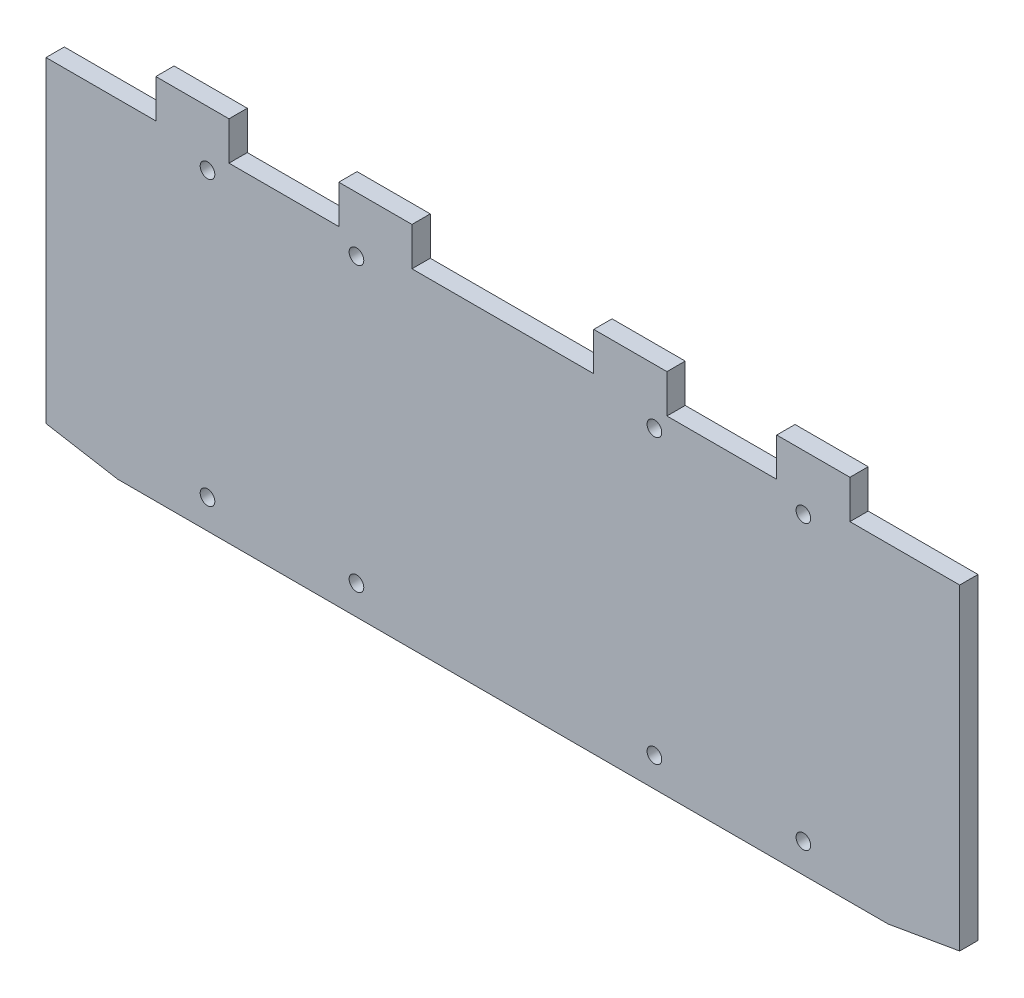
ISO-10303-21;
HEADER;
FILE_DESCRIPTION(('STEP AP214'),'2;1');
FILE_NAME('part.step','',(''),(''),'','','');
FILE_SCHEMA(('AUTOMOTIVE_DESIGN { 1 0 10303 214 1 1 1 1 }'));
ENDSEC;
DATA;
#1=APPLICATION_CONTEXT('core data for automotive mechanical design processes');
#2=APPLICATION_PROTOCOL_DEFINITION('international standard','automotive_design',2000,#1);
#3=PRODUCT_CONTEXT('',#1,'mechanical');
#4=PRODUCT('Part','Part','',(#3));
#5=PRODUCT_RELATED_PRODUCT_CATEGORY('part','',(#4));
#6=PRODUCT_DEFINITION_FORMATION('','',#4);
#7=PRODUCT_DEFINITION_CONTEXT('part definition',#1,'design');
#8=PRODUCT_DEFINITION('design','',#6,#7);
#9=PRODUCT_DEFINITION_SHAPE('','',#8);
#10=(LENGTH_UNIT() NAMED_UNIT(*) SI_UNIT(.MILLI.,.METRE.));
#11=(NAMED_UNIT(*) PLANE_ANGLE_UNIT() SI_UNIT($,.RADIAN.));
#12=(NAMED_UNIT(*) SI_UNIT($,.STERADIAN.) SOLID_ANGLE_UNIT());
#13=UNCERTAINTY_MEASURE_WITH_UNIT(LENGTH_MEASURE(1.E-05),#10,'distance_accuracy_value','');
#14=(GEOMETRIC_REPRESENTATION_CONTEXT(3) GLOBAL_UNCERTAINTY_ASSIGNED_CONTEXT((#13)) GLOBAL_UNIT_ASSIGNED_CONTEXT((#10,
#11,#12)) REPRESENTATION_CONTEXT('',''));
#15=CARTESIAN_POINT('',(0.,0.,0.));
#16=DIRECTION('',(0.,0.,1.));
#17=DIRECTION('',(1.,0.,0.));
#18=AXIS2_PLACEMENT_3D('',#15,#16,#17);
#19=CARTESIAN_POINT('',(0.,0.,3.175));
#20=DIRECTION('',(0.,0.,-1.));
#21=DIRECTION('',(-1.,0.,0.));
#22=AXIS2_PLACEMENT_3D('',#19,#20,#21);
#23=PLANE('',#22);
#24=CARTESIAN_POINT('',(-51.7,-1.66260446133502,3.175));
#25=DIRECTION('',(0.,0.,1.));
#26=DIRECTION('',(1.,0.,0.));
#27=AXIS2_PLACEMENT_3D('',#24,#25,#26);
#28=CIRCLE('',#27,1.27000000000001);
#29=CARTESIAN_POINT('',(-50.43,-1.66260446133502,3.175));
#30=VERTEX_POINT('',#29);
#31=EDGE_CURVE('E438',#30,#30,#28,.T.);
#32=ORIENTED_EDGE('',*,*,#31,.F.);
#33=EDGE_LOOP('',(#32));
#34=FACE_BOUND('',#33,.T.);
#35=CARTESIAN_POINT('',(-51.7,-50.8,3.175));
#36=DIRECTION('',(0.,0.,1.));
#37=DIRECTION('',(1.,0.,0.));
#38=AXIS2_PLACEMENT_3D('',#35,#36,#37);
#39=CIRCLE('',#38,1.27000000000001);
#40=CARTESIAN_POINT('',(-50.43,-50.8,3.175));
#41=VERTEX_POINT('',#40);
#42=EDGE_CURVE('E450',#41,#41,#39,.T.);
#43=ORIENTED_EDGE('',*,*,#42,.F.);
#44=EDGE_LOOP('',(#43));
#45=FACE_BOUND('',#44,.T.);
#46=CARTESIAN_POINT('',(-129.25,-50.8,3.175));
#47=DIRECTION('',(0.,0.,1.));
#48=DIRECTION('',(1.,0.,0.));
#49=AXIS2_PLACEMENT_3D('',#46,#47,#48);
#50=CIRCLE('',#49,1.27);
#51=CARTESIAN_POINT('',(-127.98,-50.8,3.175));
#52=VERTEX_POINT('',#51);
#53=EDGE_CURVE('E462',#52,#52,#50,.T.);
#54=ORIENTED_EDGE('',*,*,#53,.F.);
#55=EDGE_LOOP('',(#54));
#56=FACE_BOUND('',#55,.T.);
#57=CARTESIAN_POINT('',(-129.25,-1.66260446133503,3.175));
#58=DIRECTION('',(0.,0.,1.));
#59=DIRECTION('',(1.,0.,0.));
#60=AXIS2_PLACEMENT_3D('',#57,#58,#59);
#61=CIRCLE('',#60,1.27);
#62=CARTESIAN_POINT('',(-127.98,-1.66260446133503,3.175));
#63=VERTEX_POINT('',#62);
#64=EDGE_CURVE('E218',#63,#63,#61,.T.);
#65=ORIENTED_EDGE('',*,*,#64,.F.);
#66=EDGE_LOOP('',(#65));
#67=FACE_BOUND('',#66,.T.);
#68=DIRECTION('',(0.,1.,0.));
#69=VECTOR('',#68,1.);
#70=CARTESIAN_POINT('',(1.26999999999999,1.27,3.175));
#71=LINE('',#70,#69);
#72=CARTESIAN_POINT('',(1.27,-53.732604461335,3.175));
#73=VERTEX_POINT('',#72);
#74=CARTESIAN_POINT('',(1.26999999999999,1.27,3.175));
#75=VERTEX_POINT('',#74);
#76=EDGE_CURVE('E257',#73,#75,#71,.T.);
#77=ORIENTED_EDGE('',*,*,#76,.T.);
#78=DIRECTION('',(-1.,0.,0.));
#79=VECTOR('',#78,1.);
#80=CARTESIAN_POINT('',(1.26999999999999,1.27,3.175));
#81=LINE('',#80,#79);
#82=CARTESIAN_POINT('',(-17.78,1.27,3.175));
#83=VERTEX_POINT('',#82);
#84=EDGE_CURVE('E135',#75,#83,#81,.T.);
#85=ORIENTED_EDGE('',*,*,#84,.T.);
#86=DIRECTION('',(0.,1.,0.));
#87=VECTOR('',#86,1.);
#88=CARTESIAN_POINT('',(-17.78,1.27,3.175));
#89=LINE('',#88,#87);
#90=CARTESIAN_POINT('',(-17.78,7.9375,3.175));
#91=VERTEX_POINT('',#90);
#92=EDGE_CURVE('E314',#83,#91,#89,.T.);
#93=ORIENTED_EDGE('',*,*,#92,.T.);
#94=DIRECTION('',(-1.,0.,0.));
#95=VECTOR('',#94,1.);
#96=CARTESIAN_POINT('',(-17.78,7.9375,3.175));
#97=LINE('',#96,#95);
#98=CARTESIAN_POINT('',(-30.48,7.9375,3.175));
#99=VERTEX_POINT('',#98);
#100=EDGE_CURVE('E333',#91,#99,#97,.T.);
#101=ORIENTED_EDGE('',*,*,#100,.T.);
#102=DIRECTION('',(0.,-1.,0.));
#103=VECTOR('',#102,1.);
#104=CARTESIAN_POINT('',(-30.48,7.9375,3.175));
#105=LINE('',#104,#103);
#106=CARTESIAN_POINT('',(-30.48,1.27,3.175));
#107=VERTEX_POINT('',#106);
#108=EDGE_CURVE('E330',#99,#107,#105,.T.);
#109=ORIENTED_EDGE('',*,*,#108,.T.);
#110=DIRECTION('',(-1.,0.,0.));
#111=VECTOR('',#110,1.);
#112=CARTESIAN_POINT('',(-30.48,1.27,3.175));
#113=LINE('',#112,#111);
#114=CARTESIAN_POINT('',(-49.53,1.27,3.175));
#115=VERTEX_POINT('',#114);
#116=EDGE_CURVE('E332',#107,#115,#113,.T.);
#117=ORIENTED_EDGE('',*,*,#116,.T.);
#118=DIRECTION('',(0.,1.,0.));
#119=VECTOR('',#118,1.);
#120=CARTESIAN_POINT('',(-49.53,1.27,3.175));
#121=LINE('',#120,#119);
#122=CARTESIAN_POINT('',(-49.53,7.9375,3.175));
#123=VERTEX_POINT('',#122);
#124=EDGE_CURVE('E335',#115,#123,#121,.T.);
#125=ORIENTED_EDGE('',*,*,#124,.T.);
#126=DIRECTION('',(-1.,0.,0.));
#127=VECTOR('',#126,1.);
#128=CARTESIAN_POINT('',(-49.53,7.9375,3.175));
#129=LINE('',#128,#127);
#130=CARTESIAN_POINT('',(-62.23,7.9375,3.175));
#131=VERTEX_POINT('',#130);
#132=EDGE_CURVE('E341',#123,#131,#129,.T.);
#133=ORIENTED_EDGE('',*,*,#132,.T.);
#134=DIRECTION('',(0.,-1.,0.));
#135=VECTOR('',#134,1.);
#136=CARTESIAN_POINT('',(-62.23,7.9375,3.175));
#137=LINE('',#136,#135);
#138=CARTESIAN_POINT('',(-62.23,1.27,3.175));
#139=VERTEX_POINT('',#138);
#140=EDGE_CURVE('E343',#131,#139,#137,.T.);
#141=ORIENTED_EDGE('',*,*,#140,.T.);
#142=DIRECTION('',(-1.,0.,0.));
#143=VECTOR('',#142,1.);
#144=CARTESIAN_POINT('',(-93.77,1.27,3.175));
#145=LINE('',#144,#143);
#146=CARTESIAN_POINT('',(-93.77,1.27,3.175));
#147=VERTEX_POINT('',#146);
#148=EDGE_CURVE('E345',#139,#147,#145,.T.);
#149=ORIENTED_EDGE('',*,*,#148,.T.);
#150=DIRECTION('',(0.,1.,0.));
#151=VECTOR('',#150,1.);
#152=CARTESIAN_POINT('',(-93.77,7.9375,3.175));
#153=LINE('',#152,#151);
#154=CARTESIAN_POINT('',(-93.77,7.9375,3.175));
#155=VERTEX_POINT('',#154);
#156=EDGE_CURVE('E347',#147,#155,#153,.T.);
#157=ORIENTED_EDGE('',*,*,#156,.T.);
#158=DIRECTION('',(-1.,0.,0.));
#159=VECTOR('',#158,1.);
#160=CARTESIAN_POINT('',(-106.47,7.9375,3.175));
#161=LINE('',#160,#159);
#162=CARTESIAN_POINT('',(-106.47,7.9375,3.175));
#163=VERTEX_POINT('',#162);
#164=EDGE_CURVE('E349',#155,#163,#161,.T.);
#165=ORIENTED_EDGE('',*,*,#164,.T.);
#166=DIRECTION('',(0.,-1.,0.));
#167=VECTOR('',#166,1.);
#168=CARTESIAN_POINT('',(-106.47,1.27,3.175));
#169=LINE('',#168,#167);
#170=CARTESIAN_POINT('',(-106.47,1.27,3.175));
#171=VERTEX_POINT('',#170);
#172=EDGE_CURVE('E351',#163,#171,#169,.T.);
#173=ORIENTED_EDGE('',*,*,#172,.T.);
#174=DIRECTION('',(-1.,0.,0.));
#175=VECTOR('',#174,1.);
#176=CARTESIAN_POINT('',(-125.52,1.27,3.175));
#177=LINE('',#176,#175);
#178=CARTESIAN_POINT('',(-125.52,1.27,3.175));
#179=VERTEX_POINT('',#178);
#180=EDGE_CURVE('E353',#171,#179,#177,.T.);
#181=ORIENTED_EDGE('',*,*,#180,.T.);
#182=DIRECTION('',(0.,1.,0.));
#183=VECTOR('',#182,1.);
#184=CARTESIAN_POINT('',(-125.52,7.9375,3.175));
#185=LINE('',#184,#183);
#186=CARTESIAN_POINT('',(-125.52,7.9375,3.175));
#187=VERTEX_POINT('',#186);
#188=EDGE_CURVE('E355',#179,#187,#185,.T.);
#189=ORIENTED_EDGE('',*,*,#188,.T.);
#190=DIRECTION('',(-1.,0.,0.));
#191=VECTOR('',#190,1.);
#192=CARTESIAN_POINT('',(-138.22,7.9375,3.175));
#193=LINE('',#192,#191);
#194=CARTESIAN_POINT('',(-138.22,7.9375,3.175));
#195=VERTEX_POINT('',#194);
#196=EDGE_CURVE('E357',#187,#195,#193,.T.);
#197=ORIENTED_EDGE('',*,*,#196,.T.);
#198=DIRECTION('',(0.,-1.,0.));
#199=VECTOR('',#198,1.);
#200=CARTESIAN_POINT('',(-138.22,1.27,3.175));
#201=LINE('',#200,#199);
#202=CARTESIAN_POINT('',(-138.22,1.27,3.175));
#203=VERTEX_POINT('',#202);
#204=EDGE_CURVE('E359',#195,#203,#201,.T.);
#205=ORIENTED_EDGE('',*,*,#204,.T.);
#206=DIRECTION('',(-1.,0.,0.));
#207=VECTOR('',#206,1.);
#208=CARTESIAN_POINT('',(-157.27,1.27,3.175));
#209=LINE('',#208,#207);
#210=CARTESIAN_POINT('',(-157.27,1.27,3.175));
#211=VERTEX_POINT('',#210);
#212=EDGE_CURVE('E361',#203,#211,#209,.T.);
#213=ORIENTED_EDGE('',*,*,#212,.T.);
#214=DIRECTION('',(0.,-1.,0.));
#215=VECTOR('',#214,1.);
#216=CARTESIAN_POINT('',(-157.27,-53.732604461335,3.175));
#217=LINE('',#216,#215);
#218=CARTESIAN_POINT('',(-157.27,-53.732604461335,3.175));
#219=VERTEX_POINT('',#218);
#220=EDGE_CURVE('E196',#211,#219,#217,.T.);
#221=ORIENTED_EDGE('',*,*,#220,.T.);
#222=DIRECTION('',(0.985397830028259,-0.170267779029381,0.));
#223=VECTOR('',#222,1.);
#224=CARTESIAN_POINT('',(-144.842288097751,-55.88,3.175));
#225=LINE('',#224,#223);
#226=CARTESIAN_POINT('',(-144.842288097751,-55.88,3.175));
#227=VERTEX_POINT('',#226);
#228=EDGE_CURVE('E190',#219,#227,#225,.T.);
#229=ORIENTED_EDGE('',*,*,#228,.T.);
#230=DIRECTION('',(1.,0.,0.));
#231=VECTOR('',#230,1.);
#232=CARTESIAN_POINT('',(-11.1577119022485,-55.88,3.175));
#233=LINE('',#232,#231);
#234=CARTESIAN_POINT('',(-11.1577119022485,-55.88,3.175));
#235=VERTEX_POINT('',#234);
#236=EDGE_CURVE('E194',#227,#235,#233,.T.);
#237=ORIENTED_EDGE('',*,*,#236,.T.);
#238=DIRECTION('',(0.985397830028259,0.17026777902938,0.));
#239=VECTOR('',#238,1.);
#240=CARTESIAN_POINT('',(1.27,-53.732604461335,3.175));
#241=LINE('',#240,#239);
#242=EDGE_CURVE('E50',#235,#73,#241,.T.);
#243=ORIENTED_EDGE('',*,*,#242,.T.);
#244=EDGE_LOOP('',(#77,#85,#93,#101,#109,#117,#125,#133,#141,#149,#157,#165,#173,#181,#189,#197,
#205,#213,#221,#229,#237,#243));
#245=FACE_BOUND('',#244,.T.);
#246=CARTESIAN_POINT('',(-103.4,-1.66260446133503,3.175));
#247=DIRECTION('',(0.,0.,1.));
#248=DIRECTION('',(1.,0.,0.));
#249=AXIS2_PLACEMENT_3D('',#246,#247,#248);
#250=CIRCLE('',#249,1.27000000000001);
#251=CARTESIAN_POINT('',(-102.13,-1.66260446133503,3.175));
#252=VERTEX_POINT('',#251);
#253=EDGE_CURVE('E468',#252,#252,#250,.T.);
#254=ORIENTED_EDGE('',*,*,#253,.F.);
#255=EDGE_LOOP('',(#254));
#256=FACE_BOUND('',#255,.T.);
#257=CARTESIAN_POINT('',(-103.4,-50.8,3.175));
#258=DIRECTION('',(0.,0.,1.));
#259=DIRECTION('',(1.,0.,0.));
#260=AXIS2_PLACEMENT_3D('',#257,#258,#259);
#261=CIRCLE('',#260,1.27000000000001);
#262=CARTESIAN_POINT('',(-102.13,-50.8,3.175));
#263=VERTEX_POINT('',#262);
#264=EDGE_CURVE('E456',#263,#263,#261,.T.);
#265=ORIENTED_EDGE('',*,*,#264,.F.);
#266=EDGE_LOOP('',(#265));
#267=FACE_BOUND('',#266,.T.);
#268=CARTESIAN_POINT('',(-25.85,-50.8,3.175));
#269=DIRECTION('',(0.,0.,1.));
#270=DIRECTION('',(1.,0.,0.));
#271=AXIS2_PLACEMENT_3D('',#268,#269,#270);
#272=CIRCLE('',#271,1.27000000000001);
#273=CARTESIAN_POINT('',(-24.58,-50.8,3.175));
#274=VERTEX_POINT('',#273);
#275=EDGE_CURVE('E444',#274,#274,#272,.T.);
#276=ORIENTED_EDGE('',*,*,#275,.F.);
#277=EDGE_LOOP('',(#276));
#278=FACE_BOUND('',#277,.T.);
#279=CARTESIAN_POINT('',(-25.85,-1.66260446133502,3.175));
#280=DIRECTION('',(0.,0.,1.));
#281=DIRECTION('',(1.,0.,0.));
#282=AXIS2_PLACEMENT_3D('',#279,#280,#281);
#283=CIRCLE('',#282,1.27);
#284=CARTESIAN_POINT('',(-24.58,-1.66260446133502,3.175));
#285=VERTEX_POINT('',#284);
#286=EDGE_CURVE('E429',#285,#285,#283,.T.);
#287=ORIENTED_EDGE('',*,*,#286,.F.);
#288=EDGE_LOOP('',(#287));
#289=FACE_BOUND('',#288,.T.);
#290=ADVANCED_FACE('F33',(#34,#45,#56,#67,#245,#256,#267,#278,#289),#23,.F.);
#291=CARTESIAN_POINT('',(0.,0.,0.));
#292=DIRECTION('',(0.,0.,-1.));
#293=DIRECTION('',(-1.,0.,0.));
#294=AXIS2_PLACEMENT_3D('',#291,#292,#293);
#295=PLANE('',#294);
#296=CARTESIAN_POINT('',(-51.7,-1.66260446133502,0.));
#297=DIRECTION('',(0.,0.,1.));
#298=DIRECTION('',(1.,0.,0.));
#299=AXIS2_PLACEMENT_3D('',#296,#297,#298);
#300=CIRCLE('',#299,1.27000000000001);
#301=CARTESIAN_POINT('',(-50.43,-1.66260446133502,0.));
#302=VERTEX_POINT('',#301);
#303=EDGE_CURVE('E435',#302,#302,#300,.T.);
#304=ORIENTED_EDGE('',*,*,#303,.T.);
#305=EDGE_LOOP('',(#304));
#306=FACE_BOUND('',#305,.T.);
#307=CARTESIAN_POINT('',(-51.7,-50.8,0.));
#308=DIRECTION('',(0.,0.,1.));
#309=DIRECTION('',(1.,0.,0.));
#310=AXIS2_PLACEMENT_3D('',#307,#308,#309);
#311=CIRCLE('',#310,1.27000000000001);
#312=CARTESIAN_POINT('',(-50.43,-50.8,0.));
#313=VERTEX_POINT('',#312);
#314=EDGE_CURVE('E447',#313,#313,#311,.T.);
#315=ORIENTED_EDGE('',*,*,#314,.T.);
#316=EDGE_LOOP('',(#315));
#317=FACE_BOUND('',#316,.T.);
#318=CARTESIAN_POINT('',(-129.25,-50.8,0.));
#319=DIRECTION('',(0.,0.,1.));
#320=DIRECTION('',(1.,0.,0.));
#321=AXIS2_PLACEMENT_3D('',#318,#319,#320);
#322=CIRCLE('',#321,1.27);
#323=CARTESIAN_POINT('',(-127.98,-50.8,0.));
#324=VERTEX_POINT('',#323);
#325=EDGE_CURVE('E459',#324,#324,#322,.T.);
#326=ORIENTED_EDGE('',*,*,#325,.T.);
#327=EDGE_LOOP('',(#326));
#328=FACE_BOUND('',#327,.T.);
#329=CARTESIAN_POINT('',(-129.25,-1.66260446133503,0.));
#330=DIRECTION('',(0.,0.,1.));
#331=DIRECTION('',(1.,0.,0.));
#332=AXIS2_PLACEMENT_3D('',#329,#330,#331);
#333=CIRCLE('',#332,1.27);
#334=CARTESIAN_POINT('',(-127.98,-1.66260446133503,0.));
#335=VERTEX_POINT('',#334);
#336=EDGE_CURVE('E471',#335,#335,#333,.T.);
#337=ORIENTED_EDGE('',*,*,#336,.T.);
#338=EDGE_LOOP('',(#337));
#339=FACE_BOUND('',#338,.T.);
#340=DIRECTION('',(0.,1.,0.));
#341=VECTOR('',#340,1.);
#342=CARTESIAN_POINT('',(1.26999999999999,1.27,0.));
#343=LINE('',#342,#341);
#344=CARTESIAN_POINT('',(1.27,-53.732604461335,0.));
#345=VERTEX_POINT('',#344);
#346=CARTESIAN_POINT('',(1.26999999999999,1.27,0.));
#347=VERTEX_POINT('',#346);
#348=EDGE_CURVE('E214',#345,#347,#343,.T.);
#349=ORIENTED_EDGE('',*,*,#348,.F.);
#350=DIRECTION('',(0.985397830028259,0.17026777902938,0.));
#351=VECTOR('',#350,1.);
#352=CARTESIAN_POINT('',(1.27,-53.732604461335,0.));
#353=LINE('',#352,#351);
#354=CARTESIAN_POINT('',(-11.1577119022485,-55.88,0.));
#355=VERTEX_POINT('',#354);
#356=EDGE_CURVE('E127',#355,#345,#353,.T.);
#357=ORIENTED_EDGE('',*,*,#356,.F.);
#358=DIRECTION('',(1.,0.,0.));
#359=VECTOR('',#358,1.);
#360=CARTESIAN_POINT('',(-11.1577119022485,-55.88,0.));
#361=LINE('',#360,#359);
#362=CARTESIAN_POINT('',(-144.842288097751,-55.88,0.));
#363=VERTEX_POINT('',#362);
#364=EDGE_CURVE('E121',#363,#355,#361,.T.);
#365=ORIENTED_EDGE('',*,*,#364,.F.);
#366=DIRECTION('',(0.985397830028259,-0.170267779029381,0.));
#367=VECTOR('',#366,1.);
#368=CARTESIAN_POINT('',(-144.842288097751,-55.88,0.));
#369=LINE('',#368,#367);
#370=CARTESIAN_POINT('',(-157.27,-53.732604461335,0.));
#371=VERTEX_POINT('',#370);
#372=EDGE_CURVE('E204',#371,#363,#369,.T.);
#373=ORIENTED_EDGE('',*,*,#372,.F.);
#374=DIRECTION('',(0.,-1.,0.));
#375=VECTOR('',#374,1.);
#376=CARTESIAN_POINT('',(-157.27,-53.732604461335,0.));
#377=LINE('',#376,#375);
#378=CARTESIAN_POINT('',(-157.27,1.27,0.));
#379=VERTEX_POINT('',#378);
#380=EDGE_CURVE('E252',#379,#371,#377,.T.);
#381=ORIENTED_EDGE('',*,*,#380,.F.);
#382=DIRECTION('',(-1.,0.,0.));
#383=VECTOR('',#382,1.);
#384=CARTESIAN_POINT('',(-157.27,1.27,0.));
#385=LINE('',#384,#383);
#386=CARTESIAN_POINT('',(-138.22,1.27,0.));
#387=VERTEX_POINT('',#386);
#388=EDGE_CURVE('E250',#387,#379,#385,.T.);
#389=ORIENTED_EDGE('',*,*,#388,.F.);
#390=DIRECTION('',(0.,-1.,0.));
#391=VECTOR('',#390,1.);
#392=CARTESIAN_POINT('',(-138.22,1.27,0.));
#393=LINE('',#392,#391);
#394=CARTESIAN_POINT('',(-138.22,7.9375,0.));
#395=VERTEX_POINT('',#394);
#396=EDGE_CURVE('E248',#395,#387,#393,.T.);
#397=ORIENTED_EDGE('',*,*,#396,.F.);
#398=DIRECTION('',(-1.,0.,0.));
#399=VECTOR('',#398,1.);
#400=CARTESIAN_POINT('',(-138.22,7.9375,0.));
#401=LINE('',#400,#399);
#402=CARTESIAN_POINT('',(-125.52,7.9375,0.));
#403=VERTEX_POINT('',#402);
#404=EDGE_CURVE('E246',#403,#395,#401,.T.);
#405=ORIENTED_EDGE('',*,*,#404,.F.);
#406=DIRECTION('',(0.,1.,0.));
#407=VECTOR('',#406,1.);
#408=CARTESIAN_POINT('',(-125.52,7.9375,0.));
#409=LINE('',#408,#407);
#410=CARTESIAN_POINT('',(-125.52,1.27,0.));
#411=VERTEX_POINT('',#410);
#412=EDGE_CURVE('E244',#411,#403,#409,.T.);
#413=ORIENTED_EDGE('',*,*,#412,.F.);
#414=DIRECTION('',(-1.,0.,0.));
#415=VECTOR('',#414,1.);
#416=CARTESIAN_POINT('',(-125.52,1.27,0.));
#417=LINE('',#416,#415);
#418=CARTESIAN_POINT('',(-106.47,1.27,0.));
#419=VERTEX_POINT('',#418);
#420=EDGE_CURVE('E242',#419,#411,#417,.T.);
#421=ORIENTED_EDGE('',*,*,#420,.F.);
#422=DIRECTION('',(0.,-1.,0.));
#423=VECTOR('',#422,1.);
#424=CARTESIAN_POINT('',(-106.47,1.27,0.));
#425=LINE('',#424,#423);
#426=CARTESIAN_POINT('',(-106.47,7.9375,0.));
#427=VERTEX_POINT('',#426);
#428=EDGE_CURVE('E240',#427,#419,#425,.T.);
#429=ORIENTED_EDGE('',*,*,#428,.F.);
#430=DIRECTION('',(-1.,0.,0.));
#431=VECTOR('',#430,1.);
#432=CARTESIAN_POINT('',(-106.47,7.9375,0.));
#433=LINE('',#432,#431);
#434=CARTESIAN_POINT('',(-93.77,7.9375,0.));
#435=VERTEX_POINT('',#434);
#436=EDGE_CURVE('E238',#435,#427,#433,.T.);
#437=ORIENTED_EDGE('',*,*,#436,.F.);
#438=DIRECTION('',(0.,1.,0.));
#439=VECTOR('',#438,1.);
#440=CARTESIAN_POINT('',(-93.77,7.9375,0.));
#441=LINE('',#440,#439);
#442=CARTESIAN_POINT('',(-93.77,1.27,0.));
#443=VERTEX_POINT('',#442);
#444=EDGE_CURVE('E236',#443,#435,#441,.T.);
#445=ORIENTED_EDGE('',*,*,#444,.F.);
#446=DIRECTION('',(-1.,0.,0.));
#447=VECTOR('',#446,1.);
#448=CARTESIAN_POINT('',(-93.77,1.27,0.));
#449=LINE('',#448,#447);
#450=CARTESIAN_POINT('',(-62.23,1.27,0.));
#451=VERTEX_POINT('',#450);
#452=EDGE_CURVE('E234',#451,#443,#449,.T.);
#453=ORIENTED_EDGE('',*,*,#452,.F.);
#454=DIRECTION('',(0.,-1.,0.));
#455=VECTOR('',#454,1.);
#456=CARTESIAN_POINT('',(-62.23,7.9375,0.));
#457=LINE('',#456,#455);
#458=CARTESIAN_POINT('',(-62.23,7.9375,0.));
#459=VERTEX_POINT('',#458);
#460=EDGE_CURVE('E232',#459,#451,#457,.T.);
#461=ORIENTED_EDGE('',*,*,#460,.F.);
#462=DIRECTION('',(-1.,0.,0.));
#463=VECTOR('',#462,1.);
#464=CARTESIAN_POINT('',(-49.53,7.9375,0.));
#465=LINE('',#464,#463);
#466=CARTESIAN_POINT('',(-49.53,7.9375,0.));
#467=VERTEX_POINT('',#466);
#468=EDGE_CURVE('E230',#467,#459,#465,.T.);
#469=ORIENTED_EDGE('',*,*,#468,.F.);
#470=DIRECTION('',(0.,1.,0.));
#471=VECTOR('',#470,1.);
#472=CARTESIAN_POINT('',(-49.53,1.27,0.));
#473=LINE('',#472,#471);
#474=CARTESIAN_POINT('',(-49.53,1.27,0.));
#475=VERTEX_POINT('',#474);
#476=EDGE_CURVE('E228',#475,#467,#473,.T.);
#477=ORIENTED_EDGE('',*,*,#476,.F.);
#478=DIRECTION('',(-1.,0.,0.));
#479=VECTOR('',#478,1.);
#480=CARTESIAN_POINT('',(-30.48,1.27,0.));
#481=LINE('',#480,#479);
#482=CARTESIAN_POINT('',(-30.48,1.27,0.));
#483=VERTEX_POINT('',#482);
#484=EDGE_CURVE('E226',#483,#475,#481,.T.);
#485=ORIENTED_EDGE('',*,*,#484,.F.);
#486=DIRECTION('',(0.,-1.,0.));
#487=VECTOR('',#486,1.);
#488=CARTESIAN_POINT('',(-30.48,7.9375,0.));
#489=LINE('',#488,#487);
#490=CARTESIAN_POINT('',(-30.48,7.9375,0.));
#491=VERTEX_POINT('',#490);
#492=EDGE_CURVE('E224',#491,#483,#489,.T.);
#493=ORIENTED_EDGE('',*,*,#492,.F.);
#494=DIRECTION('',(-1.,0.,0.));
#495=VECTOR('',#494,1.);
#496=CARTESIAN_POINT('',(-17.78,7.9375,0.));
#497=LINE('',#496,#495);
#498=CARTESIAN_POINT('',(-17.78,7.9375,0.));
#499=VERTEX_POINT('',#498);
#500=EDGE_CURVE('E222',#499,#491,#497,.T.);
#501=ORIENTED_EDGE('',*,*,#500,.F.);
#502=DIRECTION('',(0.,1.,0.));
#503=VECTOR('',#502,1.);
#504=CARTESIAN_POINT('',(-17.78,1.27,0.));
#505=LINE('',#504,#503);
#506=CARTESIAN_POINT('',(-17.78,1.27,0.));
#507=VERTEX_POINT('',#506);
#508=EDGE_CURVE('E220',#507,#499,#505,.T.);
#509=ORIENTED_EDGE('',*,*,#508,.F.);
#510=DIRECTION('',(-1.,0.,0.));
#511=VECTOR('',#510,1.);
#512=CARTESIAN_POINT('',(1.26999999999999,1.27,0.));
#513=LINE('',#512,#511);
#514=EDGE_CURVE('E217',#347,#507,#513,.T.);
#515=ORIENTED_EDGE('',*,*,#514,.F.);
#516=EDGE_LOOP('',(#349,#357,#365,#373,#381,#389,#397,#405,#413,#421,#429,#437,#445,#453,#461,
#469,#477,#485,#493,#501,#509,#515));
#517=FACE_BOUND('',#516,.T.);
#518=CARTESIAN_POINT('',(-103.4,-1.66260446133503,0.));
#519=DIRECTION('',(0.,0.,1.));
#520=DIRECTION('',(1.,0.,0.));
#521=AXIS2_PLACEMENT_3D('',#518,#519,#520);
#522=CIRCLE('',#521,1.27000000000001);
#523=CARTESIAN_POINT('',(-102.13,-1.66260446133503,0.));
#524=VERTEX_POINT('',#523);
#525=EDGE_CURVE('E465',#524,#524,#522,.T.);
#526=ORIENTED_EDGE('',*,*,#525,.T.);
#527=EDGE_LOOP('',(#526));
#528=FACE_BOUND('',#527,.T.);
#529=CARTESIAN_POINT('',(-103.4,-50.8,0.));
#530=DIRECTION('',(0.,0.,1.));
#531=DIRECTION('',(1.,0.,0.));
#532=AXIS2_PLACEMENT_3D('',#529,#530,#531);
#533=CIRCLE('',#532,1.27000000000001);
#534=CARTESIAN_POINT('',(-102.13,-50.8,0.));
#535=VERTEX_POINT('',#534);
#536=EDGE_CURVE('E453',#535,#535,#533,.T.);
#537=ORIENTED_EDGE('',*,*,#536,.T.);
#538=EDGE_LOOP('',(#537));
#539=FACE_BOUND('',#538,.T.);
#540=CARTESIAN_POINT('',(-25.85,-50.8,0.));
#541=DIRECTION('',(0.,0.,1.));
#542=DIRECTION('',(1.,0.,0.));
#543=AXIS2_PLACEMENT_3D('',#540,#541,#542);
#544=CIRCLE('',#543,1.27000000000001);
#545=CARTESIAN_POINT('',(-24.58,-50.8,0.));
#546=VERTEX_POINT('',#545);
#547=EDGE_CURVE('E441',#546,#546,#544,.T.);
#548=ORIENTED_EDGE('',*,*,#547,.T.);
#549=EDGE_LOOP('',(#548));
#550=FACE_BOUND('',#549,.T.);
#551=CARTESIAN_POINT('',(-25.85,-1.66260446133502,0.));
#552=DIRECTION('',(0.,0.,1.));
#553=DIRECTION('',(1.,0.,0.));
#554=AXIS2_PLACEMENT_3D('',#551,#552,#553);
#555=CIRCLE('',#554,1.27);
#556=CARTESIAN_POINT('',(-24.58,-1.66260446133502,0.));
#557=VERTEX_POINT('',#556);
#558=EDGE_CURVE('E432',#557,#557,#555,.T.);
#559=ORIENTED_EDGE('',*,*,#558,.T.);
#560=EDGE_LOOP('',(#559));
#561=FACE_BOUND('',#560,.T.);
#562=ADVANCED_FACE('F318',(#306,#317,#328,#339,#517,#528,#539,#550,#561),#295,.T.);
#563=CARTESIAN_POINT('',(1.26999999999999,1.27,3.175));
#564=DIRECTION('',(-1.,0.,0.));
#565=DIRECTION('',(0.,-1.,0.));
#566=AXIS2_PLACEMENT_3D('',#563,#564,#565);
#567=PLANE('',#566);
#568=ORIENTED_EDGE('',*,*,#348,.T.);
#569=DIRECTION('',(0.,0.,-1.));
#570=VECTOR('',#569,1.);
#571=CARTESIAN_POINT('',(1.26999999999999,1.27,3.175));
#572=LINE('',#571,#570);
#573=EDGE_CURVE('E11',#75,#347,#572,.T.);
#574=ORIENTED_EDGE('',*,*,#573,.F.);
#575=ORIENTED_EDGE('',*,*,#76,.F.);
#576=DIRECTION('',(0.,0.,-1.));
#577=VECTOR('',#576,1.);
#578=CARTESIAN_POINT('',(1.27,-53.732604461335,3.175));
#579=LINE('',#578,#577);
#580=EDGE_CURVE('E210',#73,#345,#579,.T.);
#581=ORIENTED_EDGE('',*,*,#580,.T.);
#582=EDGE_LOOP('',(#568,#574,#575,#581));
#583=FACE_BOUND('',#582,.T.);
#584=ADVANCED_FACE('F35',(#583),#567,.F.);
#585=CARTESIAN_POINT('',(1.26999999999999,1.27,3.175));
#586=DIRECTION('',(0.,-1.,0.));
#587=DIRECTION('',(1.,0.,0.));
#588=AXIS2_PLACEMENT_3D('',#585,#586,#587);
#589=PLANE('',#588);
#590=ORIENTED_EDGE('',*,*,#514,.T.);
#591=DIRECTION('',(0.,0.,-1.));
#592=VECTOR('',#591,1.);
#593=CARTESIAN_POINT('',(-17.78,1.27,3.175));
#594=LINE('',#593,#592);
#595=EDGE_CURVE('E42',#83,#507,#594,.T.);
#596=ORIENTED_EDGE('',*,*,#595,.F.);
#597=ORIENTED_EDGE('',*,*,#84,.F.);
#598=ORIENTED_EDGE('',*,*,#573,.T.);
#599=EDGE_LOOP('',(#590,#596,#597,#598));
#600=FACE_BOUND('',#599,.T.);
#601=ADVANCED_FACE('F716',(#600),#589,.F.);
#602=CARTESIAN_POINT('',(-17.78,1.27,3.175));
#603=DIRECTION('',(-1.,0.,0.));
#604=DIRECTION('',(0.,0.,1.));
#605=AXIS2_PLACEMENT_3D('',#602,#603,#604);
#606=PLANE('',#605);
#607=ORIENTED_EDGE('',*,*,#508,.T.);
#608=DIRECTION('',(0.,0.,-1.));
#609=VECTOR('',#608,1.);
#610=CARTESIAN_POINT('',(-17.78,7.9375,3.175));
#611=LINE('',#610,#609);
#612=EDGE_CURVE('E306',#91,#499,#611,.T.);
#613=ORIENTED_EDGE('',*,*,#612,.F.);
#614=ORIENTED_EDGE('',*,*,#92,.F.);
#615=ORIENTED_EDGE('',*,*,#595,.T.);
#616=EDGE_LOOP('',(#607,#613,#614,#615));
#617=FACE_BOUND('',#616,.T.);
#618=ADVANCED_FACE('F312',(#617),#606,.F.);
#619=CARTESIAN_POINT('',(-17.78,7.9375,3.175));
#620=DIRECTION('',(0.,-1.,0.));
#621=DIRECTION('',(0.,0.,-1.));
#622=AXIS2_PLACEMENT_3D('',#619,#620,#621);
#623=PLANE('',#622);
#624=ORIENTED_EDGE('',*,*,#500,.T.);
#625=DIRECTION('',(0.,0.,-1.));
#626=VECTOR('',#625,1.);
#627=CARTESIAN_POINT('',(-30.48,7.9375,3.175));
#628=LINE('',#627,#626);
#629=EDGE_CURVE('E303',#99,#491,#628,.T.);
#630=ORIENTED_EDGE('',*,*,#629,.F.);
#631=ORIENTED_EDGE('',*,*,#100,.F.);
#632=ORIENTED_EDGE('',*,*,#612,.T.);
#633=EDGE_LOOP('',(#624,#630,#631,#632));
#634=FACE_BOUND('',#633,.T.);
#635=ADVANCED_FACE('F324',(#634),#623,.F.);
#636=CARTESIAN_POINT('',(-30.48,7.9375,3.175));
#637=DIRECTION('',(1.,0.,0.));
#638=DIRECTION('',(0.,0.,-1.));
#639=AXIS2_PLACEMENT_3D('',#636,#637,#638);
#640=PLANE('',#639);
#641=ORIENTED_EDGE('',*,*,#492,.T.);
#642=DIRECTION('',(0.,0.,-1.));
#643=VECTOR('',#642,1.);
#644=CARTESIAN_POINT('',(-30.48,1.27,3.175));
#645=LINE('',#644,#643);
#646=EDGE_CURVE('E300',#107,#483,#645,.T.);
#647=ORIENTED_EDGE('',*,*,#646,.F.);
#648=ORIENTED_EDGE('',*,*,#108,.F.);
#649=ORIENTED_EDGE('',*,*,#629,.T.);
#650=EDGE_LOOP('',(#641,#647,#648,#649));
#651=FACE_BOUND('',#650,.T.);
#652=ADVANCED_FACE('F328',(#651),#640,.F.);
#653=CARTESIAN_POINT('',(-30.48,1.27,3.175));
#654=DIRECTION('',(0.,-1.,0.));
#655=DIRECTION('',(1.,0.,0.));
#656=AXIS2_PLACEMENT_3D('',#653,#654,#655);
#657=PLANE('',#656);
#658=ORIENTED_EDGE('',*,*,#484,.T.);
#659=DIRECTION('',(0.,0.,-1.));
#660=VECTOR('',#659,1.);
#661=CARTESIAN_POINT('',(-49.53,1.27,3.175));
#662=LINE('',#661,#660);
#663=EDGE_CURVE('E297',#115,#475,#662,.T.);
#664=ORIENTED_EDGE('',*,*,#663,.F.);
#665=ORIENTED_EDGE('',*,*,#116,.F.);
#666=ORIENTED_EDGE('',*,*,#646,.T.);
#667=EDGE_LOOP('',(#658,#664,#665,#666));
#668=FACE_BOUND('',#667,.T.);
#669=ADVANCED_FACE('F681',(#668),#657,.F.);
#670=CARTESIAN_POINT('',(-49.53,1.27,3.175));
#671=DIRECTION('',(-1.,0.,0.));
#672=DIRECTION('',(0.,0.,1.));
#673=AXIS2_PLACEMENT_3D('',#670,#671,#672);
#674=PLANE('',#673);
#675=ORIENTED_EDGE('',*,*,#476,.T.);
#676=DIRECTION('',(0.,0.,-1.));
#677=VECTOR('',#676,1.);
#678=CARTESIAN_POINT('',(-49.53,7.9375,3.175));
#679=LINE('',#678,#677);
#680=EDGE_CURVE('E294',#123,#467,#679,.T.);
#681=ORIENTED_EDGE('',*,*,#680,.F.);
#682=ORIENTED_EDGE('',*,*,#124,.F.);
#683=ORIENTED_EDGE('',*,*,#663,.T.);
#684=EDGE_LOOP('',(#675,#681,#682,#683));
#685=FACE_BOUND('',#684,.T.);
#686=ADVANCED_FACE('F671',(#685),#674,.F.);
#687=CARTESIAN_POINT('',(-49.53,7.9375,3.175));
#688=DIRECTION('',(0.,-1.,0.));
#689=DIRECTION('',(0.,0.,-1.));
#690=AXIS2_PLACEMENT_3D('',#687,#688,#689);
#691=PLANE('',#690);
#692=ORIENTED_EDGE('',*,*,#468,.T.);
#693=DIRECTION('',(0.,0.,-1.));
#694=VECTOR('',#693,1.);
#695=CARTESIAN_POINT('',(-62.23,7.9375,3.175));
#696=LINE('',#695,#694);
#697=EDGE_CURVE('E291',#131,#459,#696,.T.);
#698=ORIENTED_EDGE('',*,*,#697,.F.);
#699=ORIENTED_EDGE('',*,*,#132,.F.);
#700=ORIENTED_EDGE('',*,*,#680,.T.);
#701=EDGE_LOOP('',(#692,#698,#699,#700));
#702=FACE_BOUND('',#701,.T.);
#703=ADVANCED_FACE('F661',(#702),#691,.F.);
#704=CARTESIAN_POINT('',(-62.23,7.9375,3.175));
#705=DIRECTION('',(1.,0.,0.));
#706=DIRECTION('',(0.,0.,-1.));
#707=AXIS2_PLACEMENT_3D('',#704,#705,#706);
#708=PLANE('',#707);
#709=ORIENTED_EDGE('',*,*,#460,.T.);
#710=DIRECTION('',(0.,0.,-1.));
#711=VECTOR('',#710,1.);
#712=CARTESIAN_POINT('',(-62.23,1.27,3.175));
#713=LINE('',#712,#711);
#714=EDGE_CURVE('E288',#139,#451,#713,.T.);
#715=ORIENTED_EDGE('',*,*,#714,.F.);
#716=ORIENTED_EDGE('',*,*,#140,.F.);
#717=ORIENTED_EDGE('',*,*,#697,.T.);
#718=EDGE_LOOP('',(#709,#715,#716,#717));
#719=FACE_BOUND('',#718,.T.);
#720=ADVANCED_FACE('F651',(#719),#708,.F.);
#721=CARTESIAN_POINT('',(-93.77,1.27,3.175));
#722=DIRECTION('',(0.,-1.,0.));
#723=DIRECTION('',(0.,0.,-1.));
#724=AXIS2_PLACEMENT_3D('',#721,#722,#723);
#725=PLANE('',#724);
#726=ORIENTED_EDGE('',*,*,#452,.T.);
#727=DIRECTION('',(0.,0.,-1.));
#728=VECTOR('',#727,1.);
#729=CARTESIAN_POINT('',(-93.77,1.27,3.175));
#730=LINE('',#729,#728);
#731=EDGE_CURVE('E285',#147,#443,#730,.T.);
#732=ORIENTED_EDGE('',*,*,#731,.F.);
#733=ORIENTED_EDGE('',*,*,#148,.F.);
#734=ORIENTED_EDGE('',*,*,#714,.T.);
#735=EDGE_LOOP('',(#726,#732,#733,#734));
#736=FACE_BOUND('',#735,.T.);
#737=ADVANCED_FACE('F641',(#736),#725,.F.);
#738=CARTESIAN_POINT('',(-93.77,7.9375,3.175));
#739=DIRECTION('',(-1.,0.,0.));
#740=DIRECTION('',(0.,0.,1.));
#741=AXIS2_PLACEMENT_3D('',#738,#739,#740);
#742=PLANE('',#741);
#743=ORIENTED_EDGE('',*,*,#444,.T.);
#744=DIRECTION('',(0.,0.,-1.));
#745=VECTOR('',#744,1.);
#746=CARTESIAN_POINT('',(-93.77,7.9375,3.175));
#747=LINE('',#746,#745);
#748=EDGE_CURVE('E282',#155,#435,#747,.T.);
#749=ORIENTED_EDGE('',*,*,#748,.F.);
#750=ORIENTED_EDGE('',*,*,#156,.F.);
#751=ORIENTED_EDGE('',*,*,#731,.T.);
#752=EDGE_LOOP('',(#743,#749,#750,#751));
#753=FACE_BOUND('',#752,.T.);
#754=ADVANCED_FACE('F631',(#753),#742,.F.);
#755=CARTESIAN_POINT('',(-106.47,7.9375,3.175));
#756=DIRECTION('',(0.,-1.,0.));
#757=DIRECTION('',(0.,0.,-1.));
#758=AXIS2_PLACEMENT_3D('',#755,#756,#757);
#759=PLANE('',#758);
#760=ORIENTED_EDGE('',*,*,#436,.T.);
#761=DIRECTION('',(0.,0.,-1.));
#762=VECTOR('',#761,1.);
#763=CARTESIAN_POINT('',(-106.47,7.9375,3.175));
#764=LINE('',#763,#762);
#765=EDGE_CURVE('E279',#163,#427,#764,.T.);
#766=ORIENTED_EDGE('',*,*,#765,.F.);
#767=ORIENTED_EDGE('',*,*,#164,.F.);
#768=ORIENTED_EDGE('',*,*,#748,.T.);
#769=EDGE_LOOP('',(#760,#766,#767,#768));
#770=FACE_BOUND('',#769,.T.);
#771=ADVANCED_FACE('F621',(#770),#759,.F.);
#772=CARTESIAN_POINT('',(-106.47,1.27,3.175));
#773=DIRECTION('',(1.,0.,0.));
#774=DIRECTION('',(0.,0.,-1.));
#775=AXIS2_PLACEMENT_3D('',#772,#773,#774);
#776=PLANE('',#775);
#777=ORIENTED_EDGE('',*,*,#428,.T.);
#778=DIRECTION('',(0.,0.,-1.));
#779=VECTOR('',#778,1.);
#780=CARTESIAN_POINT('',(-106.47,1.27,3.175));
#781=LINE('',#780,#779);
#782=EDGE_CURVE('E276',#171,#419,#781,.T.);
#783=ORIENTED_EDGE('',*,*,#782,.F.);
#784=ORIENTED_EDGE('',*,*,#172,.F.);
#785=ORIENTED_EDGE('',*,*,#765,.T.);
#786=EDGE_LOOP('',(#777,#783,#784,#785));
#787=FACE_BOUND('',#786,.T.);
#788=ADVANCED_FACE('F611',(#787),#776,.F.);
#789=CARTESIAN_POINT('',(-125.52,1.27,3.175));
#790=DIRECTION('',(0.,-1.,0.));
#791=DIRECTION('',(1.,0.,0.));
#792=AXIS2_PLACEMENT_3D('',#789,#790,#791);
#793=PLANE('',#792);
#794=ORIENTED_EDGE('',*,*,#420,.T.);
#795=DIRECTION('',(0.,0.,-1.));
#796=VECTOR('',#795,1.);
#797=CARTESIAN_POINT('',(-125.52,1.27,3.175));
#798=LINE('',#797,#796);
#799=EDGE_CURVE('E273',#179,#411,#798,.T.);
#800=ORIENTED_EDGE('',*,*,#799,.F.);
#801=ORIENTED_EDGE('',*,*,#180,.F.);
#802=ORIENTED_EDGE('',*,*,#782,.T.);
#803=EDGE_LOOP('',(#794,#800,#801,#802));
#804=FACE_BOUND('',#803,.T.);
#805=ADVANCED_FACE('F601',(#804),#793,.F.);
#806=CARTESIAN_POINT('',(-125.52,7.9375,3.175));
#807=DIRECTION('',(-1.,0.,0.));
#808=DIRECTION('',(0.,0.,1.));
#809=AXIS2_PLACEMENT_3D('',#806,#807,#808);
#810=PLANE('',#809);
#811=ORIENTED_EDGE('',*,*,#412,.T.);
#812=DIRECTION('',(0.,0.,-1.));
#813=VECTOR('',#812,1.);
#814=CARTESIAN_POINT('',(-125.52,7.9375,3.175));
#815=LINE('',#814,#813);
#816=EDGE_CURVE('E270',#187,#403,#815,.T.);
#817=ORIENTED_EDGE('',*,*,#816,.F.);
#818=ORIENTED_EDGE('',*,*,#188,.F.);
#819=ORIENTED_EDGE('',*,*,#799,.T.);
#820=EDGE_LOOP('',(#811,#817,#818,#819));
#821=FACE_BOUND('',#820,.T.);
#822=ADVANCED_FACE('F591',(#821),#810,.F.);
#823=CARTESIAN_POINT('',(-138.22,7.9375,3.175));
#824=DIRECTION('',(0.,-1.,0.));
#825=DIRECTION('',(0.,0.,-1.));
#826=AXIS2_PLACEMENT_3D('',#823,#824,#825);
#827=PLANE('',#826);
#828=ORIENTED_EDGE('',*,*,#404,.T.);
#829=DIRECTION('',(0.,0.,-1.));
#830=VECTOR('',#829,1.);
#831=CARTESIAN_POINT('',(-138.22,7.9375,3.175));
#832=LINE('',#831,#830);
#833=EDGE_CURVE('E267',#195,#395,#832,.T.);
#834=ORIENTED_EDGE('',*,*,#833,.F.);
#835=ORIENTED_EDGE('',*,*,#196,.F.);
#836=ORIENTED_EDGE('',*,*,#816,.T.);
#837=EDGE_LOOP('',(#828,#834,#835,#836));
#838=FACE_BOUND('',#837,.T.);
#839=ADVANCED_FACE('F581',(#838),#827,.F.);
#840=CARTESIAN_POINT('',(-138.22,1.27,3.175));
#841=DIRECTION('',(1.,0.,0.));
#842=DIRECTION('',(0.,0.,-1.));
#843=AXIS2_PLACEMENT_3D('',#840,#841,#842);
#844=PLANE('',#843);
#845=ORIENTED_EDGE('',*,*,#396,.T.);
#846=DIRECTION('',(0.,0.,-1.));
#847=VECTOR('',#846,1.);
#848=CARTESIAN_POINT('',(-138.22,1.27,3.175));
#849=LINE('',#848,#847);
#850=EDGE_CURVE('E264',#203,#387,#849,.T.);
#851=ORIENTED_EDGE('',*,*,#850,.F.);
#852=ORIENTED_EDGE('',*,*,#204,.F.);
#853=ORIENTED_EDGE('',*,*,#833,.T.);
#854=EDGE_LOOP('',(#845,#851,#852,#853));
#855=FACE_BOUND('',#854,.T.);
#856=ADVANCED_FACE('F572',(#855),#844,.F.);
#857=CARTESIAN_POINT('',(-157.27,1.27,3.175));
#858=DIRECTION('',(0.,-1.,0.));
#859=DIRECTION('',(1.,0.,0.));
#860=AXIS2_PLACEMENT_3D('',#857,#858,#859);
#861=PLANE('',#860);
#862=ORIENTED_EDGE('',*,*,#388,.T.);
#863=DIRECTION('',(0.,0.,-1.));
#864=VECTOR('',#863,1.);
#865=CARTESIAN_POINT('',(-157.27,1.27,3.175));
#866=LINE('',#865,#864);
#867=EDGE_CURVE('E261',#211,#379,#866,.T.);
#868=ORIENTED_EDGE('',*,*,#867,.F.);
#869=ORIENTED_EDGE('',*,*,#212,.F.);
#870=ORIENTED_EDGE('',*,*,#850,.T.);
#871=EDGE_LOOP('',(#862,#868,#869,#870));
#872=FACE_BOUND('',#871,.T.);
#873=ADVANCED_FACE('F367',(#872),#861,.F.);
#874=CARTESIAN_POINT('',(-157.27,-53.732604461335,3.175));
#875=DIRECTION('',(1.,0.,0.));
#876=DIRECTION('',(0.,0.,-1.));
#877=AXIS2_PLACEMENT_3D('',#874,#875,#876);
#878=PLANE('',#877);
#879=ORIENTED_EDGE('',*,*,#380,.T.);
#880=DIRECTION('',(0.,0.,-1.));
#881=VECTOR('',#880,1.);
#882=CARTESIAN_POINT('',(-157.27,-53.732604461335,3.175));
#883=LINE('',#882,#881);
#884=EDGE_CURVE('E205',#219,#371,#883,.T.);
#885=ORIENTED_EDGE('',*,*,#884,.F.);
#886=ORIENTED_EDGE('',*,*,#220,.F.);
#887=ORIENTED_EDGE('',*,*,#867,.T.);
#888=EDGE_LOOP('',(#879,#885,#886,#887));
#889=FACE_BOUND('',#888,.T.);
#890=ADVANCED_FACE('F371',(#889),#878,.F.);
#891=CARTESIAN_POINT('',(-144.842288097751,-55.88,3.175));
#892=DIRECTION('',(0.170267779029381,0.985397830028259,0.));
#893=DIRECTION('',(-0.985397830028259,0.170267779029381,0.));
#894=AXIS2_PLACEMENT_3D('',#891,#892,#893);
#895=PLANE('',#894);
#896=ORIENTED_EDGE('',*,*,#372,.T.);
#897=DIRECTION('',(0.,0.,-1.));
#898=VECTOR('',#897,1.);
#899=CARTESIAN_POINT('',(-144.842288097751,-55.88,3.175));
#900=LINE('',#899,#898);
#901=EDGE_CURVE('E201',#227,#363,#900,.T.);
#902=ORIENTED_EDGE('',*,*,#901,.F.);
#903=ORIENTED_EDGE('',*,*,#228,.F.);
#904=ORIENTED_EDGE('',*,*,#884,.T.);
#905=EDGE_LOOP('',(#896,#902,#903,#904));
#906=FACE_BOUND('',#905,.T.);
#907=ADVANCED_FACE('F202',(#906),#895,.F.);
#908=CARTESIAN_POINT('',(-11.1577119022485,-55.88,3.175));
#909=DIRECTION('',(0.,1.,0.));
#910=DIRECTION('',(0.,0.,1.));
#911=AXIS2_PLACEMENT_3D('',#908,#909,#910);
#912=PLANE('',#911);
#913=ORIENTED_EDGE('',*,*,#364,.T.);
#914=DIRECTION('',(0.,0.,-1.));
#915=VECTOR('',#914,1.);
#916=CARTESIAN_POINT('',(-11.1577119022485,-55.88,3.175));
#917=LINE('',#916,#915);
#918=EDGE_CURVE('E206',#235,#355,#917,.T.);
#919=ORIENTED_EDGE('',*,*,#918,.F.);
#920=ORIENTED_EDGE('',*,*,#236,.F.);
#921=ORIENTED_EDGE('',*,*,#901,.T.);
#922=EDGE_LOOP('',(#913,#919,#920,#921));
#923=FACE_BOUND('',#922,.T.);
#924=ADVANCED_FACE('F208',(#923),#912,.F.);
#925=CARTESIAN_POINT('',(1.27,-53.732604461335,3.175));
#926=DIRECTION('',(-0.17026777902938,0.985397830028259,0.));
#927=DIRECTION('',(-0.985397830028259,-0.17026777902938,0.));
#928=AXIS2_PLACEMENT_3D('',#925,#926,#927);
#929=PLANE('',#928);
#930=ORIENTED_EDGE('',*,*,#356,.T.);
#931=ORIENTED_EDGE('',*,*,#580,.F.);
#932=ORIENTED_EDGE('',*,*,#242,.F.);
#933=ORIENTED_EDGE('',*,*,#918,.T.);
#934=EDGE_LOOP('',(#930,#931,#932,#933));
#935=FACE_BOUND('',#934,.T.);
#936=ADVANCED_FACE('F375',(#935),#929,.F.);
#937=CARTESIAN_POINT('',(-129.25,-1.66260446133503,3.175));
#938=DIRECTION('',(0.,0.,-1.));
#939=DIRECTION('',(-1.,0.,0.));
#940=AXIS2_PLACEMENT_3D('',#937,#938,#939);
#941=CYLINDRICAL_SURFACE('',#940,1.27);
#942=ORIENTED_EDGE('',*,*,#64,.T.);
#943=EDGE_LOOP('',(#942));
#944=FACE_BOUND('',#943,.T.);
#945=ORIENTED_EDGE('',*,*,#336,.F.);
#946=EDGE_LOOP('',(#945));
#947=FACE_BOUND('',#946,.T.);
#948=ADVANCED_FACE('F377',(#944,#947),#941,.F.);
#949=CARTESIAN_POINT('',(-103.4,-1.66260446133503,3.175));
#950=DIRECTION('',(0.,0.,-1.));
#951=DIRECTION('',(-1.,0.,0.));
#952=AXIS2_PLACEMENT_3D('',#949,#950,#951);
#953=CYLINDRICAL_SURFACE('',#952,1.27000000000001);
#954=ORIENTED_EDGE('',*,*,#253,.T.);
#955=EDGE_LOOP('',(#954));
#956=FACE_BOUND('',#955,.T.);
#957=ORIENTED_EDGE('',*,*,#525,.F.);
#958=EDGE_LOOP('',(#957));
#959=FACE_BOUND('',#958,.T.);
#960=ADVANCED_FACE('F383',(#956,#959),#953,.F.);
#961=CARTESIAN_POINT('',(-129.25,-50.8,3.175));
#962=DIRECTION('',(0.,0.,-1.));
#963=DIRECTION('',(-1.,0.,0.));
#964=AXIS2_PLACEMENT_3D('',#961,#962,#963);
#965=CYLINDRICAL_SURFACE('',#964,1.27);
#966=ORIENTED_EDGE('',*,*,#53,.T.);
#967=EDGE_LOOP('',(#966));
#968=FACE_BOUND('',#967,.T.);
#969=ORIENTED_EDGE('',*,*,#325,.F.);
#970=EDGE_LOOP('',(#969));
#971=FACE_BOUND('',#970,.T.);
#972=ADVANCED_FACE('F400',(#968,#971),#965,.F.);
#973=CARTESIAN_POINT('',(-103.4,-50.8,3.175));
#974=DIRECTION('',(0.,0.,-1.));
#975=DIRECTION('',(-1.,0.,0.));
#976=AXIS2_PLACEMENT_3D('',#973,#974,#975);
#977=CYLINDRICAL_SURFACE('',#976,1.27000000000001);
#978=ORIENTED_EDGE('',*,*,#264,.T.);
#979=EDGE_LOOP('',(#978));
#980=FACE_BOUND('',#979,.T.);
#981=ORIENTED_EDGE('',*,*,#536,.F.);
#982=EDGE_LOOP('',(#981));
#983=FACE_BOUND('',#982,.T.);
#984=ADVANCED_FACE('F404',(#980,#983),#977,.F.);
#985=CARTESIAN_POINT('',(-51.7,-50.8,3.175));
#986=DIRECTION('',(0.,0.,-1.));
#987=DIRECTION('',(-1.,0.,0.));
#988=AXIS2_PLACEMENT_3D('',#985,#986,#987);
#989=CYLINDRICAL_SURFACE('',#988,1.27000000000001);
#990=ORIENTED_EDGE('',*,*,#42,.T.);
#991=EDGE_LOOP('',(#990));
#992=FACE_BOUND('',#991,.T.);
#993=ORIENTED_EDGE('',*,*,#314,.F.);
#994=EDGE_LOOP('',(#993));
#995=FACE_BOUND('',#994,.T.);
#996=ADVANCED_FACE('F408',(#992,#995),#989,.F.);
#997=CARTESIAN_POINT('',(-25.85,-50.8,3.175));
#998=DIRECTION('',(0.,0.,-1.));
#999=DIRECTION('',(-1.,0.,0.));
#1000=AXIS2_PLACEMENT_3D('',#997,#998,#999);
#1001=CYLINDRICAL_SURFACE('',#1000,1.27000000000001);
#1002=ORIENTED_EDGE('',*,*,#275,.T.);
#1003=EDGE_LOOP('',(#1002));
#1004=FACE_BOUND('',#1003,.T.);
#1005=ORIENTED_EDGE('',*,*,#547,.F.);
#1006=EDGE_LOOP('',(#1005));
#1007=FACE_BOUND('',#1006,.T.);
#1008=ADVANCED_FACE('F412',(#1004,#1007),#1001,.F.);
#1009=CARTESIAN_POINT('',(-51.7,-1.66260446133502,3.175));
#1010=DIRECTION('',(0.,0.,-1.));
#1011=DIRECTION('',(-1.,0.,0.));
#1012=AXIS2_PLACEMENT_3D('',#1009,#1010,#1011);
#1013=CYLINDRICAL_SURFACE('',#1012,1.27000000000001);
#1014=ORIENTED_EDGE('',*,*,#31,.T.);
#1015=EDGE_LOOP('',(#1014));
#1016=FACE_BOUND('',#1015,.T.);
#1017=ORIENTED_EDGE('',*,*,#303,.F.);
#1018=EDGE_LOOP('',(#1017));
#1019=FACE_BOUND('',#1018,.T.);
#1020=ADVANCED_FACE('F416',(#1016,#1019),#1013,.F.);
#1021=CARTESIAN_POINT('',(-25.85,-1.66260446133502,3.175));
#1022=DIRECTION('',(0.,0.,-1.));
#1023=DIRECTION('',(-1.,0.,0.));
#1024=AXIS2_PLACEMENT_3D('',#1021,#1022,#1023);
#1025=CYLINDRICAL_SURFACE('',#1024,1.27);
#1026=ORIENTED_EDGE('',*,*,#286,.T.);
#1027=EDGE_LOOP('',(#1026));
#1028=FACE_BOUND('',#1027,.T.);
#1029=ORIENTED_EDGE('',*,*,#558,.F.);
#1030=EDGE_LOOP('',(#1029));
#1031=FACE_BOUND('',#1030,.T.);
#1032=ADVANCED_FACE('F420',(#1028,#1031),#1025,.F.);
#1033=CLOSED_SHELL('',(#290,#562,#584,#601,#618,#635,#652,#669,#686,#703,#720,#737,#754,#771,
#788,#805,#822,#839,#856,#873,#890,#907,#924,#936,#948,#960,#972,#984,#996,#1008,#1020,#1032));
#1034=MANIFOLD_SOLID_BREP('B2',#1033);
#1035=ADVANCED_BREP_SHAPE_REPRESENTATION('',(#18,#1034),#14);
#1036=SHAPE_DEFINITION_REPRESENTATION(#9,#1035);
ENDSEC;
END-ISO-10303-21;
